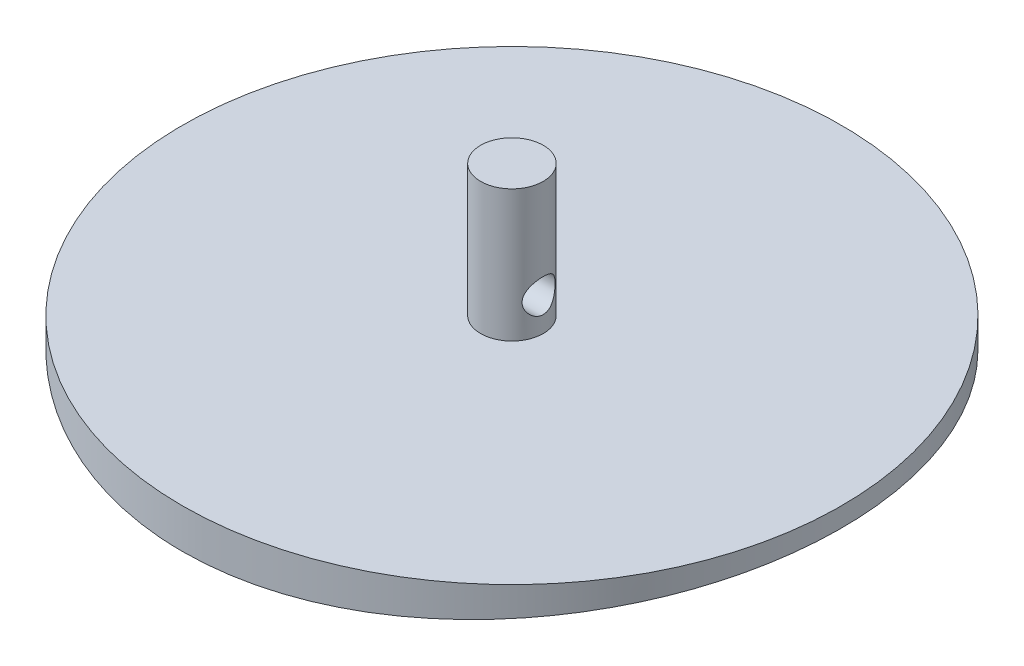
from build123d import *

# Parameters (mm, degrees)
SKETCH1_R                      = 50
BOSS_EXTRUDE1_DEPTH            = 6
SKETCH2_R                      = 4.75
BOSS_EXTRUDE2_DEPTH            = 20
CUT_EXTRUDE1_REACH             = 80.572
CUT_EXTRUDE1_END_RADIUS        = 4.75
SKETCH3_R                      = 2.5
CUT_EXTRUDE2_REACH             = 77.339
CUT_EXTRUDE2_DIRECTION_2_REACH = 77.339


with BuildPart() as part:
    # Sketch1 → Boss-Extrude1 (new body)
    with BuildSketch(Plane(origin=(0, 0, 0), x_dir=(1, 0, 0), z_dir=(0, 1, 0))):
        with Locations(Location((0, 0, 0), (0, 0, 270))):
            Circle(SKETCH1_R)
    extrude(amount=BOSS_EXTRUDE1_DEPTH)

    # Sketch2 → Boss-Extrude2 (add)
    with BuildSketch(Plane(origin=(0, 6, 0), x_dir=(1, 0, 0), z_dir=(0, 1, 0))):
        with Locations(Location((0, 0, 0), (0, 0, 270))):
            Circle(SKETCH2_R)
    extrude(amount=BOSS_EXTRUDE2_DEPTH)

    # Cut-Extrude1: up to this cylinder (the profile starts inside it)
    cut_extrude1_end = Plane(origin=(0, 11, 0), z_dir=(0, -1, 0)) * Cylinder(CUT_EXTRUDE1_END_RADIUS, 171.644, mode=Mode.PRIVATE)
    # Sketch3 → Cut-Extrude1 (cut, up to the surface)
    with BuildSketch(Plane(origin=(4.75, 0, 0), x_dir=(0, 0, -1), z_dir=(1, 0, 0)), mode=Mode.PRIVATE) as cut_extrude1_sk1:
        with Locations((0, 11)):
            Circle(SKETCH3_R)
    cut_extrude1_tool1 = extrude(cut_extrude1_sk1.sketch, amount=-CUT_EXTRUDE1_REACH, mode=Mode.PRIVATE) & cut_extrude1_end
    add(cut_extrude1_tool1.solids().sort_by_distance((4.75, 11, 0))[0], mode=Mode.SUBTRACT)

    # Sketch4 → Cut-Extrude2 (cut, up to next)
    with BuildSketch(Plane(origin=(0, 0, 0), x_dir=(0, 0, -1), z_dir=(1, 0, 0)), mode=Mode.PRIVATE) as cut_extrude2_sk1:
        with BuildLine():
            Line((-50, 0), (50, 0))
            ThreePointArc((50, 0), (0, 3.066817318), (-50, 0))
        make_face()
    cut_extrude2_tool1 = extrude(cut_extrude2_sk1.sketch, amount=-CUT_EXTRUDE2_REACH, mode=Mode.PRIVATE) & part.part
    add(cut_extrude2_tool1.solids().sort_by_distance((0, 1.227122, 0))[0], mode=Mode.SUBTRACT)

    # Sketch4 → Cut-Extrude2 direction 2 (cut, up to next)
    with BuildSketch(Plane(origin=(0, 0, 0), x_dir=(0, 0, -1), z_dir=(1, 0, 0)), mode=Mode.PRIVATE) as cut_extrude2_direction_2_sk1:
        with BuildLine():
            Line((-50, 0), (50, 0))
            ThreePointArc((50, 0), (0, 3.066817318), (-50, 0))
        make_face()
    cut_extrude2_direction_2_tool1 = extrude(cut_extrude2_direction_2_sk1.sketch, amount=CUT_EXTRUDE2_DIRECTION_2_REACH, mode=Mode.PRIVATE) & part.part
    add(cut_extrude2_direction_2_tool1.solids().sort_by_distance((0, 1.227122, 0))[0], mode=Mode.SUBTRACT)


solid = part.part
